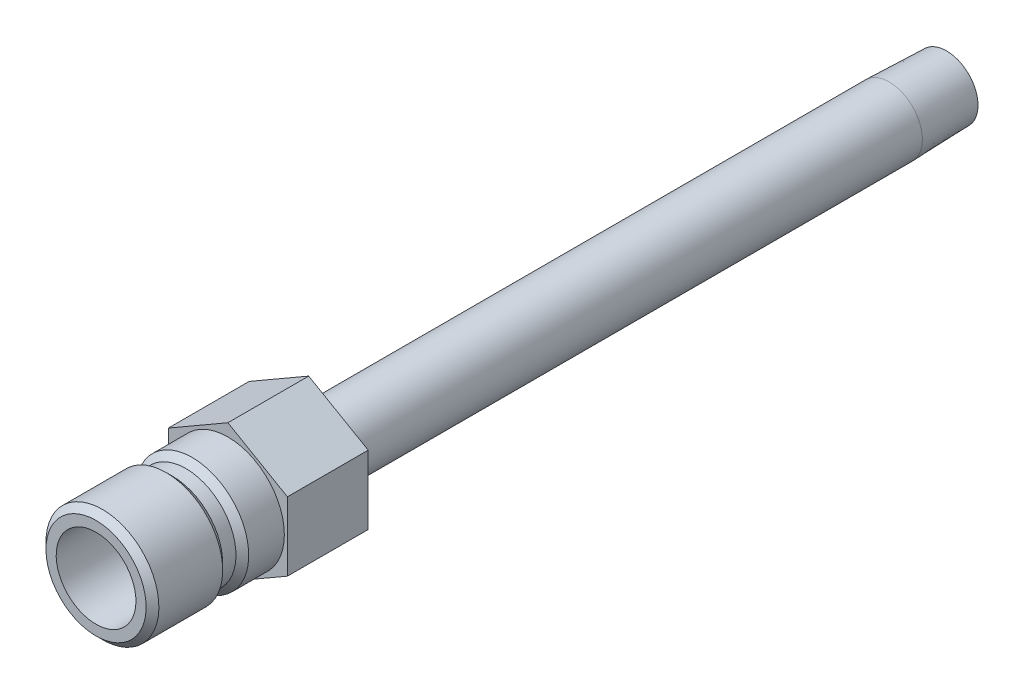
from build123d import *

# Parameters (mm, degrees)
SKETCH2_R           = 2.6543
BOSS_EXTRUDE1_DEPTH = 9.652


with BuildPart() as part:
    # Sketch1 → Revolve1 (revolve)
    with BuildSketch(Plane(origin=(0, 0, 0), x_dir=(0, 0, -1), z_dir=(1, 0, 0))):
        Polygon((-15.748, 4.7625), (-15.748, 5.9817), (-14.986, 6.7437), (-7.366, 6.7437), (-6.604, 5.9817), (-5.0165, 5.9817), (-4.2545, 6.7437), (9.652, 6.7437), (9.652, 3.96875), (78.994, 3.96875), (85.852, 3.754438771), (85.852, 2.6543), (-2.435050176, 2.6543), (-3.556, 4.7625), align=None)
    revolve(axis=Axis((0, 0, -9.652), (0, 0, 1)))

    # Sketch2 → Boss-Extrude1 (add)
    with BuildSketch(Plane.XY):
        Polygon((-7.112, 4.106115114), (-7.112, -4.106115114), (0, -8.212230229), (7.112, -4.106115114), (7.112, 4.106115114), (0, 8.212230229), align=None)
        with Locations(Location((0, 0, 0), (0, 0, 90))):
            Circle(SKETCH2_R, mode=Mode.SUBTRACT)
    extrude(amount=-BOSS_EXTRUDE1_DEPTH)


solid = part.part
